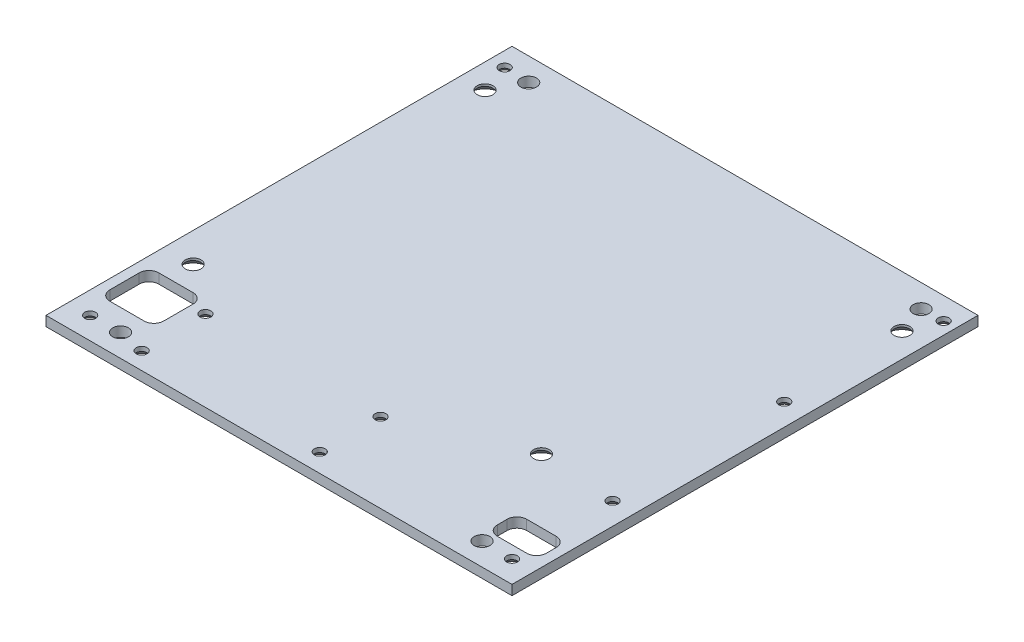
from build123d import *

# Parameters (mm, degrees)
SKETCH1_W                                    = 95
SKETCH1_H                                    = 95
BOSS_EXTRUDE1_DEPTH                          = 2
CSK_FOR_M3_COUNTERSUNK_FLAT_HEAD_SCR_2_COUNT = 2
CSK_FOR_M3_COUNTERSUNK_FLAT_HEAD_SCR_2_PITCH = 60.508263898
CSK_FOR_M3_COUNTERSUNK_FLAT_HEAD_SCR_3_COUNT = 2
CSK_FOR_M3_COUNTERSUNK_FLAT_HEAD_SCR_3_PITCH = 103.519321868
CSK_FOR_M3_COUNTERSUNK_FLAT_HEAD_SCR_4_COUNT = 2
CSK_FOR_M3_COUNTERSUNK_FLAT_HEAD_SCR_4_PITCH = 69.028979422
CSK_FOR_M2_COUNTERSUNK_FLAT_HEAD_SCR_2_COUNT = 2
CSK_FOR_M2_COUNTERSUNK_FLAT_HEAD_SCR_2_PITCH = 13
CSK_FOR_M2_COUNTERSUNK_FLAT_HEAD_SCR_3_COUNT = 2
CSK_FOR_M2_COUNTERSUNK_FLAT_HEAD_SCR_3_PITCH = 38.174467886
CSK_FOR_M2_COUNTERSUNK_FLAT_HEAD_SCR_4_COUNT = 2
CSK_FOR_M2_COUNTERSUNK_FLAT_HEAD_SCR_4_PITCH = 36
F_3_2_3_2_DIAMETER_HOLE1_D                   = 3.2
CSK_FOR_M2_COUNTERSUNK_FLAT_HEAD_SCR_5_COUNT = 2
CSK_FOR_M2_COUNTERSUNK_FLAT_HEAD_SCR_5_PITCH = 86
CSK_FOR_M2_COUNTERSUNK_FLAT_HEAD_SCR_6_COUNT = 2
CSK_FOR_M2_COUNTERSUNK_FLAT_HEAD_SCR_6_PITCH = 86.013080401
CSK_FOR_M2_COUNTERSUNK_FLAT_HEAD_SCR_7_COUNT = 2
CSK_FOR_M2_COUNTERSUNK_FLAT_HEAD_SCR_7_PITCH = 123.044707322
CUT_EXTRUDE2_DEPTH                           = 10
CUT_EXTRUDE3_DEPTH                           = 68.204910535
CSK_FOR_M2_COUNTERSUNK_FLAT_HEAD_SCR_8_COUNT = 2
CSK_FOR_M2_COUNTERSUNK_FLAT_HEAD_SCR_8_PITCH = 35


with BuildPart() as part:
    # Sketch1 → Boss-Extrude1 (new body)
    with BuildSketch(Plane(origin=(0, 0, 0), x_dir=(1, 0, 0), z_dir=(0, 1, 0))):
        Rectangle(SKETCH1_W, SKETCH1_H)
    extrude(amount=BOSS_EXTRUDE1_DEPTH)

    # Sketch2 → CSK for M3 Countersunk Flat Head Screw1 (revolve, cut)
    with BuildSketch(Plane(origin=(-41.5, 0, 23.5), x_dir=(0, 0, -1), z_dir=(1, 0, 0))):
        Polygon((0, 0), (0, 2), (1.6, 2), (1.6, 1.55), (3.15, 0), align=None)
    csk_for_m3_countersunk_flat_head_screw1 = revolve(axis=Axis((-41.5, -6.35, 23.5), (0, 1, 0)), mode=Mode.SUBTRACT)

    # CSK for M3 Countersunk Flat Head Scr 2: CSK for M3 Countersunk Flat Head Screw1 ×2
    with Locations(*[Vector(-0.016526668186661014, 0, -0.9998634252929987) * (i * CSK_FOR_M3_COUNTERSUNK_FLAT_HEAD_SCR_2_PITCH) for i in range(1, CSK_FOR_M3_COUNTERSUNK_FLAT_HEAD_SCR_2_COUNT)]):
        add(csk_for_m3_countersunk_flat_head_screw1, mode=Mode.SUBTRACT)

    # CSK for M3 Countersunk Flat Head Scr 3: CSK for M3 Countersunk Flat Head Screw1 ×2
    with Locations(*[Vector(0.8114427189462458, 0, -0.5844319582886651) * (i * CSK_FOR_M3_COUNTERSUNK_FLAT_HEAD_SCR_3_PITCH) for i in range(1, CSK_FOR_M3_COUNTERSUNK_FLAT_HEAD_SCR_3_COUNT)]):
        add(csk_for_m3_countersunk_flat_head_screw1, mode=Mode.SUBTRACT)

    # CSK for M3 Countersunk Flat Head Scr 4: CSK for M3 Countersunk Flat Head Screw1 ×2
    with Locations(*[Vector(0.9995801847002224, 0, -0.02897333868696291) * (i * CSK_FOR_M3_COUNTERSUNK_FLAT_HEAD_SCR_4_PITCH) for i in range(1, CSK_FOR_M3_COUNTERSUNK_FLAT_HEAD_SCR_4_COUNT)]):
        add(csk_for_m3_countersunk_flat_head_screw1, mode=Mode.SUBTRACT)

    # Sketch4 → CSK for M2 Countersunk Flat Head Screw1 (revolve, cut)
    with BuildSketch(Plane(origin=(-31.5, 0, 44), x_dir=(0, 0, -1), z_dir=(1, 0, 0))):
        Polygon((0, 0), (0, 2), (1.1, 2), (1.1, 1.1), (2.2, 0), align=None)
    csk_for_m2_countersunk_flat_head_screw1 = revolve(axis=Axis((-31.5, -6.35, 44), (0, 1, 0)), mode=Mode.SUBTRACT)

    # CSK for M2 Countersunk Flat Head Scr 2: CSK for M2 Countersunk Flat Head Screw1 ×2
    with Locations(*[(0, 0, -i * CSK_FOR_M2_COUNTERSUNK_FLAT_HEAD_SCR_2_PITCH) for i in range(1, CSK_FOR_M2_COUNTERSUNK_FLAT_HEAD_SCR_2_COUNT)]):
        add(csk_for_m2_countersunk_flat_head_screw1, mode=Mode.SUBTRACT)

    # CSK for M2 Countersunk Flat Head Scr 3: CSK for M2 Countersunk Flat Head Screw1 ×2
    with Locations(*[Vector(0.9430386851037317, 0, -0.3326830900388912) * (i * CSK_FOR_M2_COUNTERSUNK_FLAT_HEAD_SCR_3_PITCH) for i in range(1, CSK_FOR_M2_COUNTERSUNK_FLAT_HEAD_SCR_3_COUNT)]):
        add(csk_for_m2_countersunk_flat_head_screw1, mode=Mode.SUBTRACT)

    # CSK for M2 Countersunk Flat Head Scr 4: CSK for M2 Countersunk Flat Head Screw1 ×2
    with Locations(*[Vector(0.9999652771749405, 0, -0.008333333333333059) * (i * CSK_FOR_M2_COUNTERSUNK_FLAT_HEAD_SCR_4_PITCH) for i in range(1, CSK_FOR_M2_COUNTERSUNK_FLAT_HEAD_SCR_4_COUNT)]):
        add(csk_for_m2_countersunk_flat_head_screw1, mode=Mode.SUBTRACT)

    # 3.2 _3.2_ Diameter Hole1 (through all)
    with Locations(Plane(origin=(0, 0, 0), x_dir=(-1, 0, 0), z_dir=(0, -1, 0))):
        with Locations((36.9, -42.9), (-36.8, -42.9), (-40.6, 42.8), (39.4, 42.8)):
            Hole(F_3_2_3_2_DIAMETER_HOLE1_D / 2)

    # Sketch9 → CSK for M2 Countersunk Flat Head Screw2 (revolve, cut)
    with BuildSketch(Plane(origin=(-43, 0, 43), x_dir=(0, 0, -1), z_dir=(1, 0, 0))):
        Polygon((0, 0), (0, 2), (1.1, 2), (1.1, 1.1), (2.2, 0), align=None)
    csk_for_m2_countersunk_flat_head_screw2 = revolve(axis=Axis((-43, -6.35, 43), (0, 1, 0)), mode=Mode.SUBTRACT)

    # CSK for M2 Countersunk Flat Head Scr 5: CSK for M2 Countersunk Flat Head Screw2 ×2
    with Locations(*[(i * CSK_FOR_M2_COUNTERSUNK_FLAT_HEAD_SCR_5_PITCH, 0, 0) for i in range(1, CSK_FOR_M2_COUNTERSUNK_FLAT_HEAD_SCR_5_COUNT)]):
        add(csk_for_m2_countersunk_flat_head_screw2, mode=Mode.SUBTRACT)

    # CSK for M2 Countersunk Flat Head Scr 6: CSK for M2 Countersunk Flat Head Screw2 ×2
    with Locations(*[Vector(-0.01743920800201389, 0, -0.9998479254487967) * (i * CSK_FOR_M2_COUNTERSUNK_FLAT_HEAD_SCR_6_PITCH) for i in range(1, CSK_FOR_M2_COUNTERSUNK_FLAT_HEAD_SCR_6_COUNT)]):
        add(csk_for_m2_countersunk_flat_head_screw2, mode=Mode.SUBTRACT)

    # CSK for M2 Countersunk Flat Head Scr 7: CSK for M2 Countersunk Flat Head Screw2 ×2
    with Locations(*[Vector(0.7151872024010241, 0, -0.6989329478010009) * (i * CSK_FOR_M2_COUNTERSUNK_FLAT_HEAD_SCR_7_PITCH) for i in range(1, CSK_FOR_M2_COUNTERSUNK_FLAT_HEAD_SCR_7_COUNT)]):
        add(csk_for_m2_countersunk_flat_head_screw2, mode=Mode.SUBTRACT)

    # Sketch11 → Cut-Extrude2 (cut)
    with BuildSketch(Plane(origin=(0, 2, 0), x_dir=(1, 0, 0), z_dir=(0, 1, 0))):
        with BuildLine():
            Line((37.5, -34.5), (43.5, -34.5))
            ThreePointArc((43.5, -34.5), (44.914213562, -35.085786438), (45.5, -36.5))
            Line((45.5, -36.5), (45.5, -38.5))
            ThreePointArc((45.5, -38.5), (44.914213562, -39.914213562), (43.5, -40.5))
            Line((43.5, -40.5), (37.5, -40.5))
            ThreePointArc((37.5, -40.5), (36.085786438, -39.914213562), (35.5, -38.5))
            Line((35.5, -38.5), (35.5, -36.5))
            ThreePointArc((35.5, -36.5), (36.085786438, -35.085786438), (37.5, -34.5))
        make_face()
    extrude(amount=-CUT_EXTRUDE2_DEPTH, mode=Mode.SUBTRACT)

    # Sketch13 → Cut-Extrude3 (cut, through all)
    with BuildSketch(Plane.XZ):
        with BuildLine():
            Line((-43.5, 38.5), (-36.5, 38.5))
            ThreePointArc((-36.5, 38.5), (-35.085786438, 37.914213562), (-34.5, 36.5))
            Line((-34.5, 36.5), (-34.5, 30.5))
            ThreePointArc((-34.5, 30.5), (-35.085786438, 29.085786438), (-36.5, 28.5))
            Line((-36.5, 28.5), (-43.5, 28.5))
            ThreePointArc((-43.5, 28.5), (-44.914213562, 29.085786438), (-45.5, 30.5))
            Line((-45.5, 30.5), (-45.5, 36.5))
            ThreePointArc((-45.5, 36.5), (-44.914213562, 37.914213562), (-43.5, 38.5))
        make_face()
    extrude(amount=-CUT_EXTRUDE3_DEPTH, mode=Mode.SUBTRACT)

    # Sketch14 → CSK for M2 Countersunk Flat Head Screw3 (revolve, cut)
    with BuildSketch(Plane(origin=(43, 0, 22.5), x_dir=(0, 0, -1), z_dir=(1, 0, 0))):
        Polygon((0, 0), (0, 2), (1.1, 2), (1.1, 1.1), (2.2, 0), align=None)
    csk_for_m2_countersunk_flat_head_screw3 = revolve(axis=Axis((43, -6.35, 22.5), (0, 1, 0)), mode=Mode.SUBTRACT)

    # CSK for M2 Countersunk Flat Head Scr 8: CSK for M2 Countersunk Flat Head Screw3 ×2
    with Locations(*[(0, 0, -i * CSK_FOR_M2_COUNTERSUNK_FLAT_HEAD_SCR_8_PITCH) for i in range(1, CSK_FOR_M2_COUNTERSUNK_FLAT_HEAD_SCR_8_COUNT)]):
        add(csk_for_m2_countersunk_flat_head_screw3, mode=Mode.SUBTRACT)


solid = part.part
